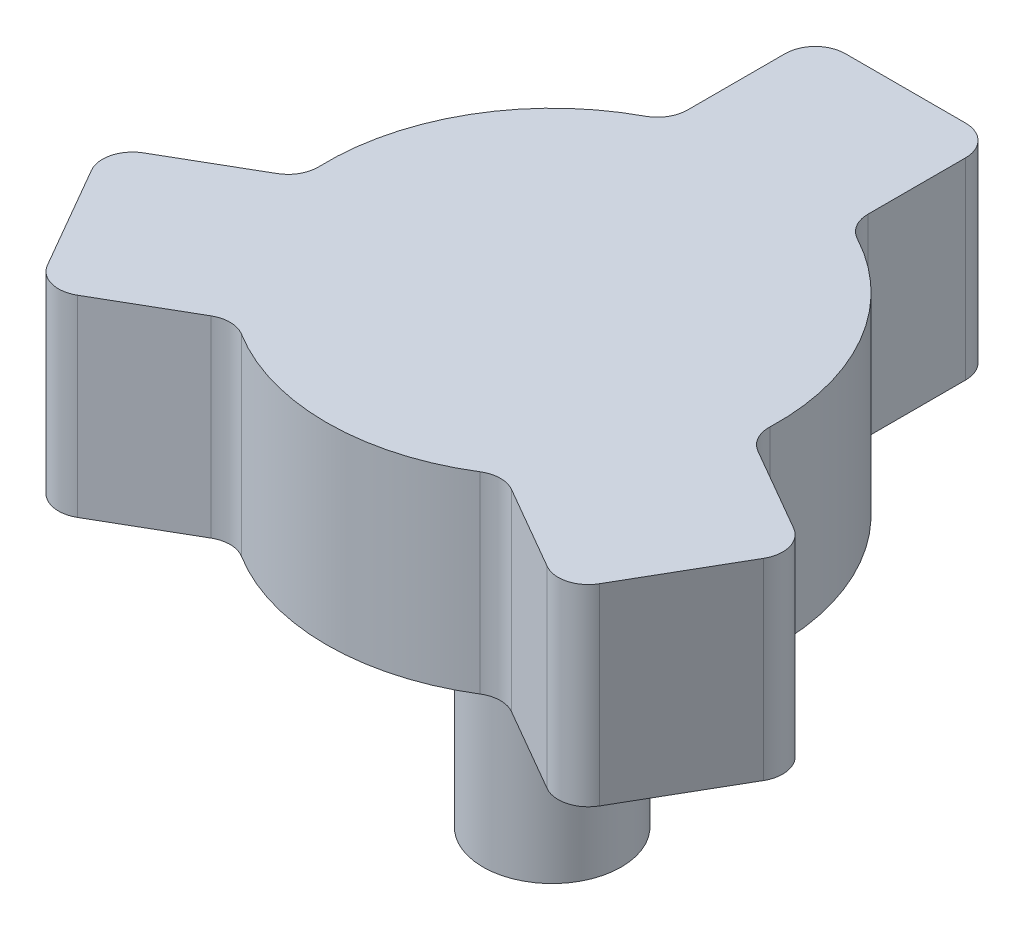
from build123d import *

# Parameters (mm, degrees)
SKETCH1_R                = 9.525
BOSS_EXTRUDE1_DEPTH      = 8.128
SKETCH2_W                = 7.62
SKETCH2_H                = 14.605
BOSS_EXTRUDE2_DEPTH      = 8.128
FILLET1_R                = 1.27
CIRPATTERN1_COUNT        = 3
FILLET1_OF_CIRPATTERN1_R = 1.27
SKETCH3_R                = 2.921
BOSS_EXTRUDE3_DEPTH      = 11.43


with BuildPart() as part:
    # Sketch1 → Boss-Extrude1 (new body)
    with BuildSketch(Plane(origin=(0, 0, 0), x_dir=(1, 0, 0), z_dir=(0, 1, 0))):
        with Locations(Location((0, 0, 0), (0, 0, 270))):
            Circle(SKETCH1_R)
    extrude(amount=BOSS_EXTRUDE1_DEPTH)

    # Sketch2 → Boss-Extrude2 (add, through all)
    with BuildSketch(Plane(origin=(0, 8.128, 0), x_dir=(1, 0, 0), z_dir=(0, 1, 0))):
        with Locations((0, 7.618280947)):
            Rectangle(SKETCH2_W, SKETCH2_H)
    boss_extrude2 = extrude(amount=-BOSS_EXTRUDE2_DEPTH)

    # Fillet1
    fillet1_edges = [part.edges().sort_by_distance(p)[0] for p in [
        (3.81, 4.064, -14.920780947),
        (3.81, 4.064, -8.729806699),
        (-3.81, 4.064, -8.729806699),
        (-3.81, 4.064, -14.920780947),
    ]]
    fillet(fillet1_edges, radius=FILLET1_R)

    # CirPattern1: Boss-Extrude2 ×3 about axis
    cirpattern1_axis = Axis((0, 0, 0), (0, 1, 0))
    for i in range(1, CIRPATTERN1_COUNT):
        add(boss_extrude2.rotate(cirpattern1_axis, i * 360 / CIRPATTERN1_COUNT))

    # Fillet1 of CirPattern1
    fillet1_of_cirpattern1_edges = [part.edges().sort_by_distance(p)[0] for p in [
        (-14.826775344, 4.064, 4.160833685),
        (-9.465234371, 4.064, 1.065346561),
        (-5.655234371, 4.064, 7.664460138),
        (-11.016775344, 4.064, 10.759947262),
        (11.016775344, 4.064, 10.759947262),
        (5.655234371, 4.064, 7.664460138),
        (9.465234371, 4.064, 1.065346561),
        (14.826775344, 4.064, 4.160833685),
    ]]
    fillet(fillet1_of_cirpattern1_edges, radius=FILLET1_OF_CIRPATTERN1_R)

    # Sketch3 → Boss-Extrude3 (add)
    with BuildSketch(Plane.XZ):
        with Locations(Location((0, 0, 0), (0, 0, 90))):
            Circle(SKETCH3_R)
    extrude(amount=BOSS_EXTRUDE3_DEPTH)


solid = part.part
